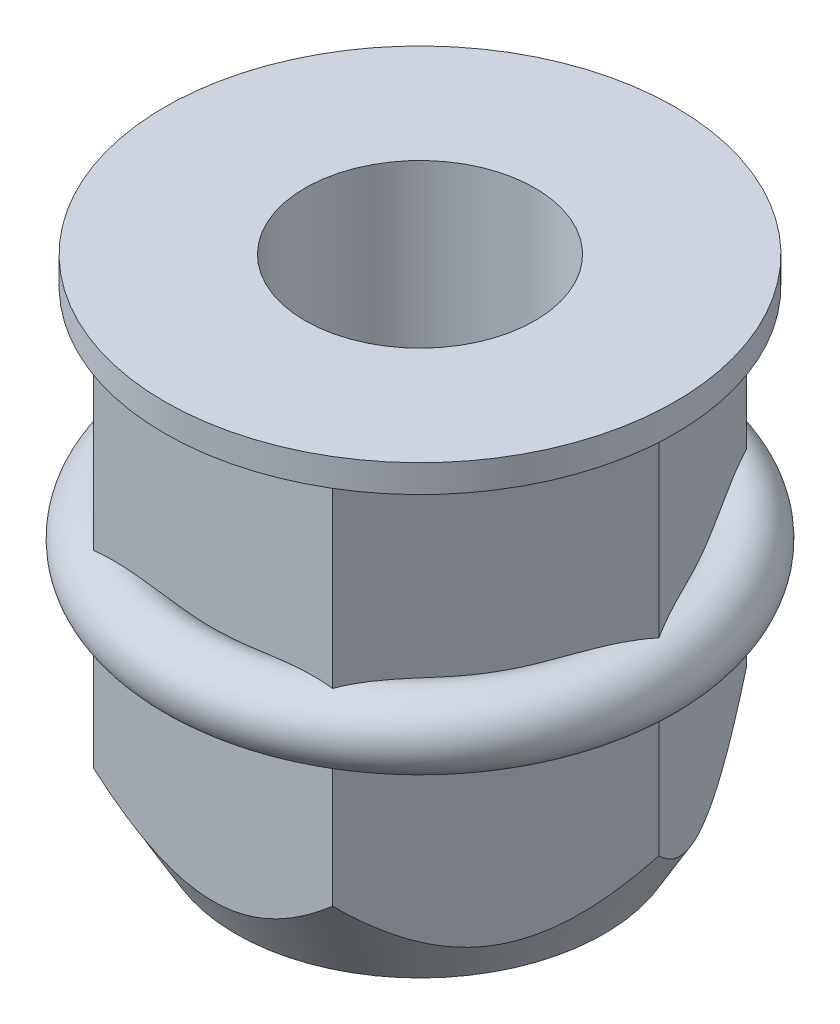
from build123d import *

# Parameters (mm, degrees)
EXTRUSION1_DEPTH  = 10.2
ESQUISSE2_R       = 5.55
EXTRUSION2_DEPTH  = 0.6
TROU_TARAUD_M61_D = 5
ESQUISSE5_R       = 0.75


with BuildPart() as part:
    # Esquisse1 → Extrusion1 (new body)
    with BuildSketch(Plane(origin=(0, 0, 0), x_dir=(1, 0, 0), z_dir=(0, 1, 0))):
        Polygon((-5.196152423, 0), (-2.598076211, -4.5), (2.598076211, -4.5), (5.196152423, 0), (2.598076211, 4.5), (-2.598076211, 4.5), align=None)
    extrude(amount=EXTRUSION1_DEPTH)

    # Esquisse2 → Extrusion2 (add)
    with BuildSketch(Plane(origin=(0, 10.2, 0), x_dir=(-1, 0, 0), z_dir=(0, 1, 0))):
        with Locations(Location((0, 0, 0), (0, 0, 90))):
            Circle(ESQUISSE2_R)
    extrude(amount=EXTRUSION2_DEPTH)

    # Trou taraud_ M61 (through all)
    with Locations(Plane.ZX.offset(10.8)):
        with Locations((0, 0)):
            Hole(TROU_TARAUD_M61_D / 2)

    # Esquisse4 → Enl_vement de mati_re-R_volution1 (revolve, cut)
    with BuildSketch(Plane.XY, mode=Mode.PRIVATE) as enl_vement_de_mati_re_r_volution1_sk:
        Polygon((-4, 0), (-7, 0), (-7, 5.196152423), align=None)
    revolve(enl_vement_de_mati_re_r_volution1_sk.sketch.rotate(Axis((0, 0, 0), (0, 1, 0)), 90), axis=Axis((0, 0, 0), (0, 1, 0)), mode=Mode.SUBTRACT)

    # Esquisse5 → R_volution1 (revolve)
    with BuildSketch(Plane.XY, mode=Mode.PRIVATE) as r_volution1_sk:
        with Locations((-5, 5.45)):
            Circle(ESQUISSE5_R)
    revolve(r_volution1_sk.sketch.rotate(Axis((0, 0, 0), (0, 1, 0)), 90), axis=Axis((0, 0, 0), (0, 1, 0)))


solid = part.part
